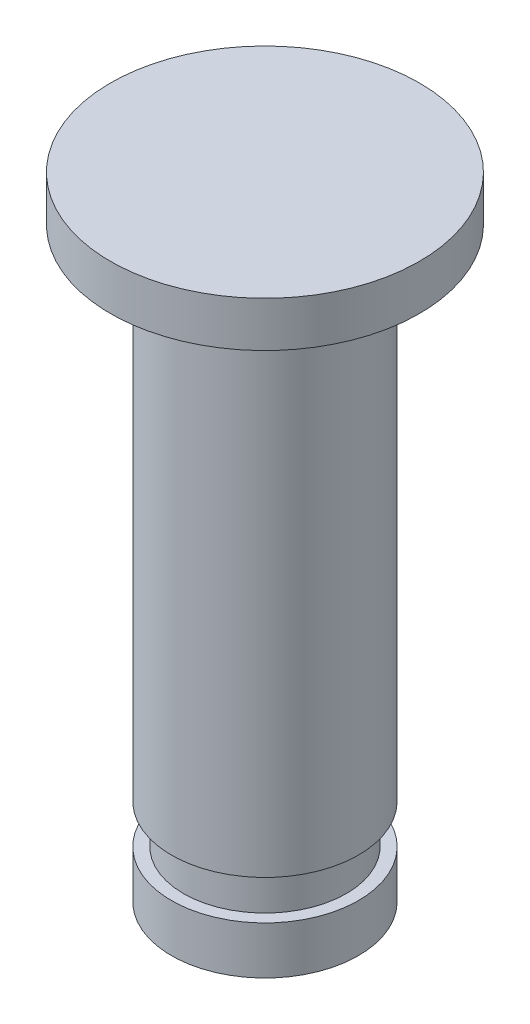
ISO-10303-21;
HEADER;
FILE_DESCRIPTION(('STEP AP214'),'2;1');
FILE_NAME('part.step','',(''),(''),'','','');
FILE_SCHEMA(('AUTOMOTIVE_DESIGN { 1 0 10303 214 1 1 1 1 }'));
ENDSEC;
DATA;
#1=APPLICATION_CONTEXT('core data for automotive mechanical design processes');
#2=APPLICATION_PROTOCOL_DEFINITION('international standard','automotive_design',2000,#1);
#3=PRODUCT_CONTEXT('',#1,'mechanical');
#4=PRODUCT('Part','Part','',(#3));
#5=PRODUCT_RELATED_PRODUCT_CATEGORY('part','',(#4));
#6=PRODUCT_DEFINITION_FORMATION('','',#4);
#7=PRODUCT_DEFINITION_CONTEXT('part definition',#1,'design');
#8=PRODUCT_DEFINITION('design','',#6,#7);
#9=PRODUCT_DEFINITION_SHAPE('','',#8);
#10=(LENGTH_UNIT() NAMED_UNIT(*) SI_UNIT(.MILLI.,.METRE.));
#11=(NAMED_UNIT(*) PLANE_ANGLE_UNIT() SI_UNIT($,.RADIAN.));
#12=(NAMED_UNIT(*) SI_UNIT($,.STERADIAN.) SOLID_ANGLE_UNIT());
#13=UNCERTAINTY_MEASURE_WITH_UNIT(LENGTH_MEASURE(1.E-05),#10,'distance_accuracy_value','');
#14=(GEOMETRIC_REPRESENTATION_CONTEXT(3) GLOBAL_UNCERTAINTY_ASSIGNED_CONTEXT((#13)) GLOBAL_UNIT_ASSIGNED_CONTEXT((#10,
#11,#12)) REPRESENTATION_CONTEXT('',''));
#15=CARTESIAN_POINT('',(0.,0.,0.));
#16=DIRECTION('',(0.,0.,1.));
#17=DIRECTION('',(1.,0.,0.));
#18=AXIS2_PLACEMENT_3D('',#15,#16,#17);
#19=CARTESIAN_POINT('',(0.,0.,0.));
#20=DIRECTION('',(0.,1.,0.));
#21=DIRECTION('',(0.,0.,1.));
#22=AXIS2_PLACEMENT_3D('',#19,#20,#21);
#23=PLANE('',#22);
#24=CARTESIAN_POINT('',(0.,0.,0.));
#25=DIRECTION('',(0.,-1.,0.));
#26=DIRECTION('',(0.,0.,-1.));
#27=AXIS2_PLACEMENT_3D('',#24,#25,#26);
#28=CIRCLE('',#27,3.14);
#29=CARTESIAN_POINT('',(0.,0.,-3.14));
#30=VERTEX_POINT('',#29);
#31=EDGE_CURVE('E10',#30,#30,#28,.T.);
#32=ORIENTED_EDGE('',*,*,#31,.F.);
#33=EDGE_LOOP('',(#32));
#34=FACE_BOUND('',#33,.T.);
#35=ADVANCED_FACE('F30',(#34),#23,.T.);
#36=CARTESIAN_POINT('',(0.,-12.84,0.));
#37=DIRECTION('',(0.,-1.,0.));
#38=DIRECTION('',(0.,0.,-1.));
#39=AXIS2_PLACEMENT_3D('',#36,#37,#38);
#40=CYLINDRICAL_SURFACE('',#39,3.14);
#41=ORIENTED_EDGE('',*,*,#31,.T.);
#42=EDGE_LOOP('',(#41));
#43=FACE_BOUND('',#42,.T.);
#44=CARTESIAN_POINT('',(0.,-0.920000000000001,0.));
#45=DIRECTION('',(0.,-1.,0.));
#46=DIRECTION('',(0.,0.,-1.));
#47=AXIS2_PLACEMENT_3D('',#44,#45,#46);
#48=CIRCLE('',#47,3.14);
#49=CARTESIAN_POINT('',(0.,-0.920000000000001,-3.14));
#50=VERTEX_POINT('',#49);
#51=EDGE_CURVE('E36',#50,#50,#48,.T.);
#52=ORIENTED_EDGE('',*,*,#51,.F.);
#53=EDGE_LOOP('',(#52));
#54=FACE_BOUND('',#53,.T.);
#55=ADVANCED_FACE('F78',(#43,#54),#40,.T.);
#56=CARTESIAN_POINT('',(3.14,-0.92,0.));
#57=DIRECTION('',(0.,-1.,0.));
#58=DIRECTION('',(0.,0.,-1.));
#59=AXIS2_PLACEMENT_3D('',#56,#57,#58);
#60=PLANE('',#59);
#61=ORIENTED_EDGE('',*,*,#51,.T.);
#62=EDGE_LOOP('',(#61));
#63=FACE_BOUND('',#62,.T.);
#64=CARTESIAN_POINT('',(0.,-0.920000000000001,0.));
#65=DIRECTION('',(0.,-1.,0.));
#66=DIRECTION('',(0.,0.,-1.));
#67=AXIS2_PLACEMENT_3D('',#64,#65,#66);
#68=CIRCLE('',#67,1.9);
#69=CARTESIAN_POINT('',(0.,-0.920000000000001,-1.9));
#70=VERTEX_POINT('',#69);
#71=EDGE_CURVE('E40',#70,#70,#68,.T.);
#72=ORIENTED_EDGE('',*,*,#71,.F.);
#73=EDGE_LOOP('',(#72));
#74=FACE_BOUND('',#73,.T.);
#75=ADVANCED_FACE('F83',(#63,#74),#60,.T.);
#76=CARTESIAN_POINT('',(0.,-12.84,0.));
#77=DIRECTION('',(0.,-1.,0.));
#78=DIRECTION('',(0.,0.,-1.));
#79=AXIS2_PLACEMENT_3D('',#76,#77,#78);
#80=CYLINDRICAL_SURFACE('',#79,1.9);
#81=ORIENTED_EDGE('',*,*,#71,.T.);
#82=EDGE_LOOP('',(#81));
#83=FACE_BOUND('',#82,.T.);
#84=CARTESIAN_POINT('',(0.,-11.07,0.));
#85=DIRECTION('',(0.,-1.,0.));
#86=DIRECTION('',(0.,0.,-1.));
#87=AXIS2_PLACEMENT_3D('',#84,#85,#86);
#88=CIRCLE('',#87,1.9);
#89=CARTESIAN_POINT('',(0.,-11.07,-1.9));
#90=VERTEX_POINT('',#89);
#91=EDGE_CURVE('E44',#90,#90,#88,.T.);
#92=ORIENTED_EDGE('',*,*,#91,.F.);
#93=EDGE_LOOP('',(#92));
#94=FACE_BOUND('',#93,.T.);
#95=ADVANCED_FACE('F87',(#83,#94),#80,.T.);
#96=CARTESIAN_POINT('',(1.9,-11.07,0.));
#97=DIRECTION('',(0.,-1.,0.));
#98=DIRECTION('',(0.,0.,-1.));
#99=AXIS2_PLACEMENT_3D('',#96,#97,#98);
#100=PLANE('',#99);
#101=ORIENTED_EDGE('',*,*,#91,.T.);
#102=EDGE_LOOP('',(#101));
#103=FACE_BOUND('',#102,.T.);
#104=CARTESIAN_POINT('',(0.,-11.07,0.));
#105=DIRECTION('',(0.,-1.,0.));
#106=DIRECTION('',(0.,0.,-1.));
#107=AXIS2_PLACEMENT_3D('',#104,#105,#106);
#108=CIRCLE('',#107,1.655);
#109=CARTESIAN_POINT('',(0.,-11.07,-1.655));
#110=VERTEX_POINT('',#109);
#111=EDGE_CURVE('E49',#110,#110,#108,.T.);
#112=ORIENTED_EDGE('',*,*,#111,.F.);
#113=EDGE_LOOP('',(#112));
#114=FACE_BOUND('',#113,.T.);
#115=ADVANCED_FACE('F93',(#103,#114),#100,.T.);
#116=CARTESIAN_POINT('',(0.,-12.84,0.));
#117=DIRECTION('',(0.,-1.,0.));
#118=DIRECTION('',(0.,0.,-1.));
#119=AXIS2_PLACEMENT_3D('',#116,#117,#118);
#120=CYLINDRICAL_SURFACE('',#119,1.655);
#121=ORIENTED_EDGE('',*,*,#111,.T.);
#122=EDGE_LOOP('',(#121));
#123=FACE_BOUND('',#122,.T.);
#124=CARTESIAN_POINT('',(0.,-11.87,0.));
#125=DIRECTION('',(0.,-1.,0.));
#126=DIRECTION('',(0.,0.,-1.));
#127=AXIS2_PLACEMENT_3D('',#124,#125,#126);
#128=CIRCLE('',#127,1.655);
#129=CARTESIAN_POINT('',(0.,-11.87,-1.655));
#130=VERTEX_POINT('',#129);
#131=EDGE_CURVE('E52',#130,#130,#128,.T.);
#132=ORIENTED_EDGE('',*,*,#131,.F.);
#133=EDGE_LOOP('',(#132));
#134=FACE_BOUND('',#133,.T.);
#135=ADVANCED_FACE('F74',(#123,#134),#120,.T.);
#136=CARTESIAN_POINT('',(1.655,-11.87,0.));
#137=DIRECTION('',(0.,1.,0.));
#138=DIRECTION('',(0.,0.,1.));
#139=AXIS2_PLACEMENT_3D('',#136,#137,#138);
#140=PLANE('',#139);
#141=ORIENTED_EDGE('',*,*,#131,.T.);
#142=EDGE_LOOP('',(#141));
#143=FACE_BOUND('',#142,.T.);
#144=CARTESIAN_POINT('',(0.,-11.87,0.));
#145=DIRECTION('',(0.,-1.,0.));
#146=DIRECTION('',(0.,0.,-1.));
#147=AXIS2_PLACEMENT_3D('',#144,#145,#146);
#148=CIRCLE('',#147,1.9);
#149=CARTESIAN_POINT('',(0.,-11.87,-1.9));
#150=VERTEX_POINT('',#149);
#151=EDGE_CURVE('E55',#150,#150,#148,.T.);
#152=ORIENTED_EDGE('',*,*,#151,.F.);
#153=EDGE_LOOP('',(#152));
#154=FACE_BOUND('',#153,.T.);
#155=ADVANCED_FACE('F66',(#143,#154),#140,.T.);
#156=CARTESIAN_POINT('',(0.,-12.84,0.));
#157=DIRECTION('',(0.,-1.,0.));
#158=DIRECTION('',(0.,0.,-1.));
#159=AXIS2_PLACEMENT_3D('',#156,#157,#158);
#160=CYLINDRICAL_SURFACE('',#159,1.9);
#161=ORIENTED_EDGE('',*,*,#151,.T.);
#162=EDGE_LOOP('',(#161));
#163=FACE_BOUND('',#162,.T.);
#164=CARTESIAN_POINT('',(0.,-12.84,0.));
#165=DIRECTION('',(0.,-1.,0.));
#166=DIRECTION('',(0.,0.,-1.));
#167=AXIS2_PLACEMENT_3D('',#164,#165,#166);
#168=CIRCLE('',#167,1.9);
#169=CARTESIAN_POINT('',(0.,-12.84,-1.9));
#170=VERTEX_POINT('',#169);
#171=EDGE_CURVE('E58',#170,#170,#168,.T.);
#172=ORIENTED_EDGE('',*,*,#171,.F.);
#173=EDGE_LOOP('',(#172));
#174=FACE_BOUND('',#173,.T.);
#175=ADVANCED_FACE('F64',(#163,#174),#160,.T.);
#176=CARTESIAN_POINT('',(1.9,-12.84,0.));
#177=DIRECTION('',(0.,-1.,0.));
#178=DIRECTION('',(0.,0.,-1.));
#179=AXIS2_PLACEMENT_3D('',#176,#177,#178);
#180=PLANE('',#179);
#181=ORIENTED_EDGE('',*,*,#171,.T.);
#182=EDGE_LOOP('',(#181));
#183=FACE_BOUND('',#182,.T.);
#184=ADVANCED_FACE('F62',(#183),#180,.T.);
#185=CLOSED_SHELL('',(#35,#55,#75,#95,#115,#135,#155,#175,#184));
#186=MANIFOLD_SOLID_BREP('B2',#185);
#187=ADVANCED_BREP_SHAPE_REPRESENTATION('',(#18,#186),#14);
#188=SHAPE_DEFINITION_REPRESENTATION(#9,#187);
ENDSEC;
END-ISO-10303-21;
